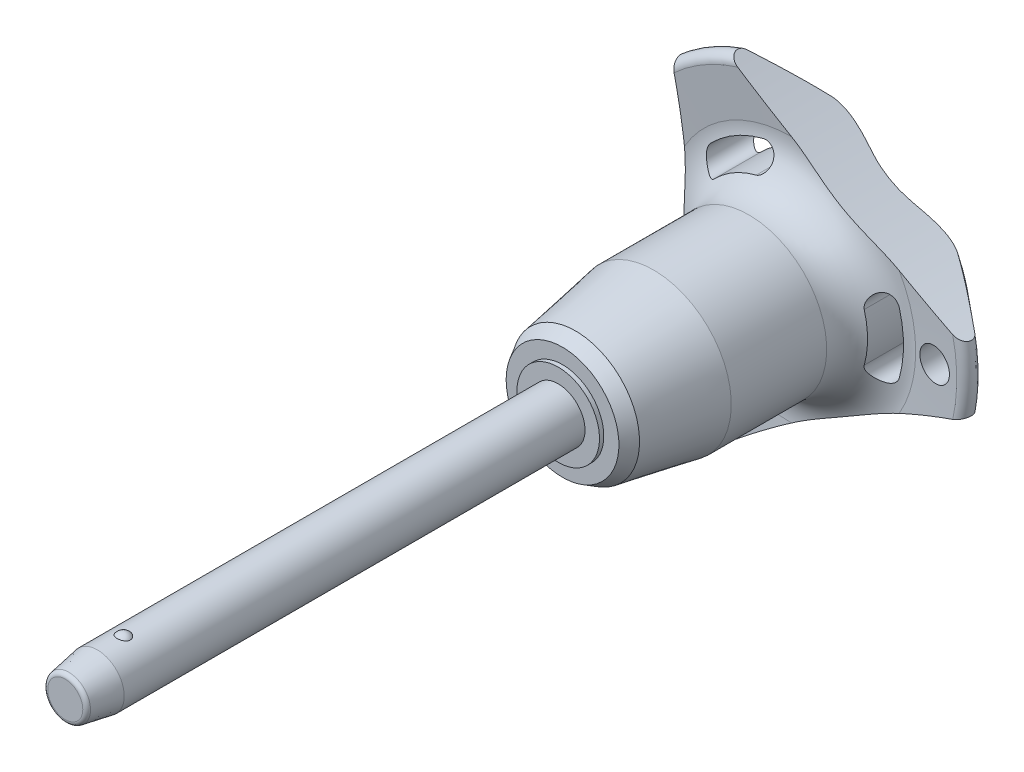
from build123d import *

# Parameters (mm, degrees)
SKETCH1_R           = 2.5
BOSS_EXTRUDE1_DEPTH = 40
SKETCH2_R           = 2.1
BOSS_EXTRUDE2_DEPTH = 26.7
BOSS_EXTRUDE3_START = 6
SKETCH1_2_R         = 2.5
BOSS_EXTRUDE3_DEPTH = 6
CHAMFER1_SIZE       = 3
CHAMFER1_SIZE2      = 0.528980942
FILLET1_R           = 0.4
SKETCH6_R           = 79.96
CUT_EXTRUDE1_DEPTH  = 71.711449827
CIRPATTERN1_COUNT   = 3
SKETCH7_R           = 1.5
CUT_EXTRUDE2_DEPTH  = 71.495866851


with BuildPart() as part:
    # Sketch1 → Boss-Extrude1 (new body)
    with BuildSketch(Plane.XY):
        Circle(SKETCH1_R)
    extrude(amount=-BOSS_EXTRUDE1_DEPTH)

    # Sketch2 → Boss-Extrude2 (add)
    with BuildSketch(Plane(origin=(0, 0, -40), x_dir=(-1, 0, 0), z_dir=(0, 0, -1))):
        Circle(SKETCH2_R)
    extrude(amount=BOSS_EXTRUDE2_DEPTH)

    # Sketch3 → Revolve1 (revolve)
    with BuildSketch(Plane(origin=(0, 0, 0), x_dir=(0, 0, -1), z_dir=(1, 0, 0))):
        with BuildLine():
            Line((-0.580947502, 2.75), (-0.580947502, 1.15))
            ThreePointArc((-0.580947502, 1.15), (0.219052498, 1.95), (-0.580947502, 2.75))
        make_face()
        with BuildLine():
            Line((-0.580947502, -1.15), (-0.580947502, -2.75))
            ThreePointArc((-0.580947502, -2.75), (0.219052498, -1.95), (-0.580947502, -1.15))
        make_face()
    revolve(axis=Axis((0, -1.15, 0.580947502), (0, 1, 0)))

    # Sketch1_2 → Boss-Extrude3 (add)
    with BuildSketch(Plane.XY.offset(BOSS_EXTRUDE3_START)):
        Circle(SKETCH1_2_R)
    extrude(amount=-BOSS_EXTRUDE3_DEPTH)

    # Chamfer1
    chamfer1_edges = [part.edges().sort_by_distance(p)[0] for p in [
        (-2.5, 0, 6),
    ]]
    chamfer1_side = [part.faces().sort_by_distance(p)[0] for p in [
        (-2.5, 0, -17),
    ]]
    chamfer(chamfer1_edges, length=CHAMFER1_SIZE, length2=CHAMFER1_SIZE2, reference=chamfer1_side[0])

    # Fillet1
    fillet1_edges = [part.edges().sort_by_distance(p)[0] for p in [
        (-1.971019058, 0, 6),
        (2.1, 0, -66.7),
    ]]
    fillet(fillet1_edges, radius=FILLET1_R)

    # Sketch4 → Revolve2 (revolve)
    with BuildSketch(Plane(origin=(0, 0, 0), x_dir=(0, 0, -1), z_dir=(1, 0, 0)), mode=Mode.PRIVATE) as revolve2_sk:
        Polygon((40, 0), (40, 3.851837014), (40.4, 3.851837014), (40.4, 5.26161122), (41.620900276, 5.966498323), (48.9, 7.25), (57.8, 7.25), (57.8, 0), align=None)
    revolve(revolve2_sk.sketch.rotate(Axis((0, 0, -57.8), (0, 0, 1)), 90), axis=Axis((0, 0, -57.8), (0, 0, 1)))

    # Sketch5 → Revolve3 (revolve)
    with BuildSketch(Plane(origin=(0, 0, 0), x_dir=(0, 0, -1), z_dir=(1, 0, 0)), mode=Mode.PRIVATE) as revolve3_sk:
        with BuildLine():
            Line((61.78715932, 11.570250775), (61.452568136, 15.735949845))
            ThreePointArc((61.452568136, 15.735949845), (61.946485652, 16.540188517), (62.862835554, 16.314230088))
            Line((62.862835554, 16.314230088), (66.326414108, 12.186497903))
            ThreePointArc((66.326414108, 12.186497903), (66.7, 11.109282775), (66.261488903, 10.056825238))
            ThreePointArc((66.261488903, 10.056825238), (63.289873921, 5.413681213), (62.25, 0))
            Line((62.25, 0), (57.8, 0))
            Line((57.8, 0), (57.8, 7.25))
            ThreePointArc((57.8, 7.25), (60.739473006, 8.537160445), (61.78715932, 11.570250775))
        make_face()
    revolve(revolve3_sk.sketch.rotate(Axis((0, 0, -62.25), (0, 0, 1)), 90), axis=Axis((0, 0, -62.25), (0, 0, 1)))

    # Sketch6 → Cut-Extrude1 (cut, through all)
    with BuildSketch(Plane.XY):
        with Locations((-89.76, 0)):
            Circle(SKETCH6_R)
        with BuildLine():
            ThreePointArc((10.099921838, -2.834717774), (10.490188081, 0), (10.099921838, 2.834717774))
            ThreePointArc((10.099921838, 2.834717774), (8.768180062, 3.582738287), (8.020159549, 2.250996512))
            ThreePointArc((8.020159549, 2.250996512), (8.330062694, 0), (8.020159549, -2.250996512))
            ThreePointArc((8.020159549, -2.250996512), (8.768180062, -3.582738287), (10.099921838, -2.834717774))
        make_face()
    cut_extrude1 = extrude(amount=-CUT_EXTRUDE1_DEPTH, mode=Mode.SUBTRACT)

    # CirPattern1: Cut-Extrude1 ×3 about axis
    cirpattern1_axis = Axis((0, 0, 0), (0, 0, 1))
    for i in range(1, CIRPATTERN1_COUNT):
        add(cut_extrude1.rotate(cirpattern1_axis, i * 360 / CIRPATTERN1_COUNT), mode=Mode.SUBTRACT)

    # Sketch7 → Cut-Extrude2 (cut, through all)
    with BuildSketch(Plane.XY):
        with Locations(Location((13.490188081, 0, 0), (0, 0, 225.221865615))):
            Circle(SKETCH7_R)
    extrude(amount=-CUT_EXTRUDE2_DEPTH, mode=Mode.SUBTRACT)


solid = part.part
